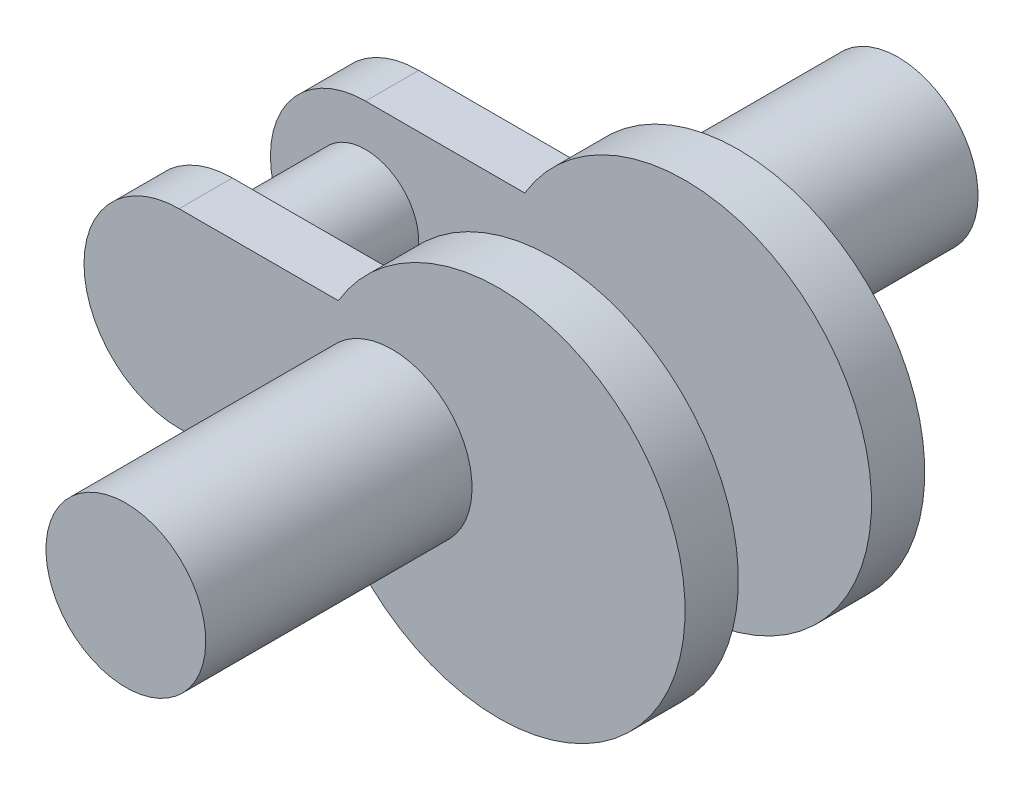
ISO-10303-21;
HEADER;
FILE_DESCRIPTION(('STEP AP214'),'2;1');
FILE_NAME('part.step','',(''),(''),'','','');
FILE_SCHEMA(('AUTOMOTIVE_DESIGN { 1 0 10303 214 1 1 1 1 }'));
ENDSEC;
DATA;
#1=APPLICATION_CONTEXT('core data for automotive mechanical design processes');
#2=APPLICATION_PROTOCOL_DEFINITION('international standard','automotive_design',2000,#1);
#3=PRODUCT_CONTEXT('',#1,'mechanical');
#4=PRODUCT('Part','Part','',(#3));
#5=PRODUCT_RELATED_PRODUCT_CATEGORY('part','',(#4));
#6=PRODUCT_DEFINITION_FORMATION('','',#4);
#7=PRODUCT_DEFINITION_CONTEXT('part definition',#1,'design');
#8=PRODUCT_DEFINITION('design','',#6,#7);
#9=PRODUCT_DEFINITION_SHAPE('','',#8);
#10=(LENGTH_UNIT() NAMED_UNIT(*) SI_UNIT(.MILLI.,.METRE.));
#11=(NAMED_UNIT(*) PLANE_ANGLE_UNIT() SI_UNIT($,.RADIAN.));
#12=(NAMED_UNIT(*) SI_UNIT($,.STERADIAN.) SOLID_ANGLE_UNIT());
#13=UNCERTAINTY_MEASURE_WITH_UNIT(LENGTH_MEASURE(1.E-05),#10,'distance_accuracy_value','');
#14=(GEOMETRIC_REPRESENTATION_CONTEXT(3) GLOBAL_UNCERTAINTY_ASSIGNED_CONTEXT((#13)) GLOBAL_UNIT_ASSIGNED_CONTEXT((#10,
#11,#12)) REPRESENTATION_CONTEXT('',''));
#15=CARTESIAN_POINT('',(0.,0.,0.));
#16=DIRECTION('',(0.,0.,1.));
#17=DIRECTION('',(1.,0.,0.));
#18=AXIS2_PLACEMENT_3D('',#15,#16,#17);
#19=CARTESIAN_POINT('',(-396.363758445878,-302.221968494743,358.902522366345));
#20=DIRECTION('',(0.,0.,-1.));
#21=DIRECTION('',(0.,-1.,0.));
#22=AXIS2_PLACEMENT_3D('',#19,#20,#21);
#23=PLANE('',#22);
#24=CARTESIAN_POINT('',(-396.363758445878,-302.221968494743,358.902522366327));
#25=DIRECTION('',(0.,0.,1.));
#26=DIRECTION('',(0.,1.,0.));
#27=AXIS2_PLACEMENT_3D('',#24,#25,#26);
#28=CIRCLE('',#27,30.);
#29=CARTESIAN_POINT('',(-396.363758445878,-272.221968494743,358.902522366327));
#30=VERTEX_POINT('',#29);
#31=EDGE_CURVE('E10',#30,#30,#28,.T.);
#32=ORIENTED_EDGE('',*,*,#31,.F.);
#33=EDGE_LOOP('',(#32));
#34=FACE_BOUND('',#33,.T.);
#35=DIRECTION('',(-1.,0.,0.));
#36=VECTOR('',#35,1.);
#37=CARTESIAN_POINT('',(-396.363758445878,-337.936254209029,358.902522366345));
#38=LINE('',#37,#36);
#39=CARTESIAN_POINT('',(-416.567494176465,-337.936254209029,358.902522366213));
#40=VERTEX_POINT('',#39);
#41=CARTESIAN_POINT('',(-476.363758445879,-337.936254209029,358.902522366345));
#42=VERTEX_POINT('',#41);
#43=EDGE_CURVE('E129',#40,#42,#38,.T.);
#44=ORIENTED_EDGE('',*,*,#43,.F.);
#45=CARTESIAN_POINT('',(-356.363758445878,-302.221968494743,358.902522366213));
#46=DIRECTION('',(0.,0.,1.));
#47=DIRECTION('',(0.,1.,0.));
#48=AXIS2_PLACEMENT_3D('',#45,#46,#47);
#49=CIRCLE('',#48,70.);
#50=CARTESIAN_POINT('',(-416.567494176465,-266.507682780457,358.902522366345));
#51=VERTEX_POINT('',#50);
#52=EDGE_CURVE('E108',#40,#51,#49,.T.);
#53=ORIENTED_EDGE('',*,*,#52,.T.);
#54=DIRECTION('',(-1.,0.,0.));
#55=VECTOR('',#54,1.);
#56=CARTESIAN_POINT('',(-396.363758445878,-266.507682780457,358.902522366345));
#57=LINE('',#56,#55);
#58=CARTESIAN_POINT('',(-476.363758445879,-266.507682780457,358.902522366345));
#59=VERTEX_POINT('',#58);
#60=EDGE_CURVE('E134',#51,#59,#57,.T.);
#61=ORIENTED_EDGE('',*,*,#60,.T.);
#62=CARTESIAN_POINT('',(-476.363758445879,-302.221968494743,358.902522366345));
#63=DIRECTION('',(0.,0.,-1.));
#64=DIRECTION('',(0.,-1.,0.));
#65=AXIS2_PLACEMENT_3D('',#62,#63,#64);
#66=CIRCLE('',#65,35.7142857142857);
#67=EDGE_CURVE('E131',#42,#59,#66,.T.);
#68=ORIENTED_EDGE('',*,*,#67,.F.);
#69=EDGE_LOOP('',(#44,#53,#61,#68));
#70=FACE_BOUND('',#69,.T.);
#71=ADVANCED_FACE('F16',(#34,#70),#23,.F.);
#72=CARTESIAN_POINT('',(-396.363758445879,-302.221968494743,288.902522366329));
#73=DIRECTION('',(0.,0.,-1.));
#74=DIRECTION('',(0.,-1.,0.));
#75=AXIS2_PLACEMENT_3D('',#72,#73,#74);
#76=PLANE('',#75);
#77=DIRECTION('',(-1.,0.,0.));
#78=VECTOR('',#77,1.);
#79=CARTESIAN_POINT('',(-396.363758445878,-337.936254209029,288.902522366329));
#80=LINE('',#79,#78);
#81=CARTESIAN_POINT('',(-416.567494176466,-337.936254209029,288.902522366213));
#82=VERTEX_POINT('',#81);
#83=CARTESIAN_POINT('',(-476.363758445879,-337.936254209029,288.902522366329));
#84=VERTEX_POINT('',#83);
#85=EDGE_CURVE('E81',#82,#84,#80,.T.);
#86=ORIENTED_EDGE('',*,*,#85,.F.);
#87=CARTESIAN_POINT('',(-356.363758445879,-302.221968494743,288.902522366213));
#88=DIRECTION('',(0.,0.,1.));
#89=DIRECTION('',(0.,1.,0.));
#90=AXIS2_PLACEMENT_3D('',#87,#88,#89);
#91=CIRCLE('',#90,70.);
#92=CARTESIAN_POINT('',(-416.567494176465,-266.507682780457,288.902522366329));
#93=VERTEX_POINT('',#92);
#94=EDGE_CURVE('E86',#82,#93,#91,.T.);
#95=ORIENTED_EDGE('',*,*,#94,.T.);
#96=DIRECTION('',(-1.,0.,0.));
#97=VECTOR('',#96,1.);
#98=CARTESIAN_POINT('',(-396.363758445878,-266.507682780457,288.902522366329));
#99=LINE('',#98,#97);
#100=CARTESIAN_POINT('',(-476.363758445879,-266.507682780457,288.902522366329));
#101=VERTEX_POINT('',#100);
#102=EDGE_CURVE('E33',#93,#101,#99,.T.);
#103=ORIENTED_EDGE('',*,*,#102,.T.);
#104=CARTESIAN_POINT('',(-476.363758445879,-302.221968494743,288.902522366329));
#105=DIRECTION('',(0.,0.,-1.));
#106=DIRECTION('',(0.,-1.,0.));
#107=AXIS2_PLACEMENT_3D('',#104,#105,#106);
#108=CIRCLE('',#107,35.7142857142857);
#109=EDGE_CURVE('E88',#84,#101,#108,.T.);
#110=ORIENTED_EDGE('',*,*,#109,.F.);
#111=EDGE_LOOP('',(#86,#95,#103,#110));
#112=FACE_BOUND('',#111,.T.);
#113=CARTESIAN_POINT('',(-476.363758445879,-302.221968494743,288.902522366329));
#114=DIRECTION('',(0.,0.,1.));
#115=DIRECTION('',(0.,1.,0.));
#116=AXIS2_PLACEMENT_3D('',#113,#114,#115);
#117=CIRCLE('',#116,20.);
#118=CARTESIAN_POINT('',(-476.363758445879,-282.221968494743,288.902522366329));
#119=VERTEX_POINT('',#118);
#120=EDGE_CURVE('E25',#119,#119,#117,.T.);
#121=ORIENTED_EDGE('',*,*,#120,.F.);
#122=EDGE_LOOP('',(#121));
#123=FACE_BOUND('',#122,.T.);
#124=ADVANCED_FACE('F83',(#112,#123),#76,.F.);
#125=CARTESIAN_POINT('',(-396.363758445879,-302.221968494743,268.902522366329));
#126=DIRECTION('',(0.,0.,-1.));
#127=DIRECTION('',(0.,-1.,0.));
#128=AXIS2_PLACEMENT_3D('',#125,#126,#127);
#129=CYLINDRICAL_SURFACE('',#128,30.);
#130=CARTESIAN_POINT('',(-396.363758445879,-302.221968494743,268.902522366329));
#131=DIRECTION('',(0.,0.,1.));
#132=DIRECTION('',(0.,1.,0.));
#133=AXIS2_PLACEMENT_3D('',#130,#131,#132);
#134=CIRCLE('',#133,30.);
#135=CARTESIAN_POINT('',(-396.363758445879,-272.221968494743,268.902522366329));
#136=VERTEX_POINT('',#135);
#137=EDGE_CURVE('E20',#136,#136,#134,.T.);
#138=ORIENTED_EDGE('',*,*,#137,.F.);
#139=EDGE_LOOP('',(#138));
#140=FACE_BOUND('',#139,.T.);
#141=CARTESIAN_POINT('',(-396.363758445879,-302.221968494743,168.902522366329));
#142=DIRECTION('',(0.,0.,1.));
#143=DIRECTION('',(0.,1.,0.));
#144=AXIS2_PLACEMENT_3D('',#141,#142,#143);
#145=CIRCLE('',#144,30.);
#146=CARTESIAN_POINT('',(-396.363758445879,-272.221968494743,168.902522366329));
#147=VERTEX_POINT('',#146);
#148=EDGE_CURVE('E158',#147,#147,#145,.T.);
#149=ORIENTED_EDGE('',*,*,#148,.T.);
#150=EDGE_LOOP('',(#149));
#151=FACE_BOUND('',#150,.T.);
#152=ADVANCED_FACE('F18',(#140,#151),#129,.T.);
#153=CARTESIAN_POINT('',(-396.363758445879,-302.221968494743,168.902522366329));
#154=DIRECTION('',(0.,0.,1.));
#155=DIRECTION('',(0.,1.,0.));
#156=AXIS2_PLACEMENT_3D('',#153,#154,#155);
#157=PLANE('',#156);
#158=ORIENTED_EDGE('',*,*,#148,.F.);
#159=EDGE_LOOP('',(#158));
#160=FACE_BOUND('',#159,.T.);
#161=ADVANCED_FACE('F168',(#160),#157,.F.);
#162=CARTESIAN_POINT('',(-396.363758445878,-266.507682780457,288.902522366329));
#163=DIRECTION('',(0.,-1.,0.));
#164=DIRECTION('',(1.,0.,0.));
#165=AXIS2_PLACEMENT_3D('',#162,#163,#164);
#166=PLANE('',#165);
#167=ORIENTED_EDGE('',*,*,#102,.F.);
#168=DIRECTION('',(0.,0.,1.));
#169=VECTOR('',#168,1.);
#170=CARTESIAN_POINT('',(-416.567494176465,-266.507682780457,268.902522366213));
#171=LINE('',#170,#169);
#172=CARTESIAN_POINT('',(-416.567494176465,-266.507682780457,268.902522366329));
#173=VERTEX_POINT('',#172);
#174=EDGE_CURVE('E37',#93,#173,#171,.F.);
#175=ORIENTED_EDGE('',*,*,#174,.T.);
#176=DIRECTION('',(-1.,0.,0.));
#177=VECTOR('',#176,1.);
#178=CARTESIAN_POINT('',(-396.363758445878,-266.507682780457,268.902522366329));
#179=LINE('',#178,#177);
#180=CARTESIAN_POINT('',(-476.363758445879,-266.507682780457,268.902522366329));
#181=VERTEX_POINT('',#180);
#182=EDGE_CURVE('E92',#173,#181,#179,.T.);
#183=ORIENTED_EDGE('',*,*,#182,.T.);
#184=DIRECTION('',(0.,0.,-1.));
#185=VECTOR('',#184,1.);
#186=CARTESIAN_POINT('',(-476.363758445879,-266.507682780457,288.902522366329));
#187=LINE('',#186,#185);
#188=EDGE_CURVE('E155',#101,#181,#187,.T.);
#189=ORIENTED_EDGE('',*,*,#188,.F.);
#190=EDGE_LOOP('',(#167,#175,#183,#189));
#191=FACE_BOUND('',#190,.T.);
#192=ADVANCED_FACE('F174',(#191),#166,.F.);
#193=CARTESIAN_POINT('',(-476.363758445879,-302.221968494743,288.902522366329));
#194=DIRECTION('',(0.,0.,-1.));
#195=DIRECTION('',(0.,-1.,0.));
#196=AXIS2_PLACEMENT_3D('',#193,#194,#195);
#197=CYLINDRICAL_SURFACE('',#196,35.7142857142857);
#198=CARTESIAN_POINT('',(-476.363758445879,-302.221968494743,268.902522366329));
#199=DIRECTION('',(0.,0.,-1.));
#200=DIRECTION('',(0.,-1.,0.));
#201=AXIS2_PLACEMENT_3D('',#198,#199,#200);
#202=CIRCLE('',#201,35.7142857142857);
#203=CARTESIAN_POINT('',(-476.363758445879,-337.936254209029,268.902522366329));
#204=VERTEX_POINT('',#203);
#205=EDGE_CURVE('E148',#204,#181,#202,.T.);
#206=ORIENTED_EDGE('',*,*,#205,.F.);
#207=DIRECTION('',(0.,0.,-1.));
#208=VECTOR('',#207,1.);
#209=CARTESIAN_POINT('',(-476.363758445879,-337.936254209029,288.902522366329));
#210=LINE('',#209,#208);
#211=EDGE_CURVE('E154',#84,#204,#210,.T.);
#212=ORIENTED_EDGE('',*,*,#211,.F.);
#213=ORIENTED_EDGE('',*,*,#109,.T.);
#214=ORIENTED_EDGE('',*,*,#188,.T.);
#215=EDGE_LOOP('',(#206,#212,#213,#214));
#216=FACE_BOUND('',#215,.T.);
#217=ADVANCED_FACE('F209',(#216),#197,.T.);
#218=CARTESIAN_POINT('',(-396.363758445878,-337.936254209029,288.902522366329));
#219=DIRECTION('',(0.,-1.,0.));
#220=DIRECTION('',(1.,0.,0.));
#221=AXIS2_PLACEMENT_3D('',#218,#219,#220);
#222=PLANE('',#221);
#223=DIRECTION('',(0.,0.,1.));
#224=VECTOR('',#223,1.);
#225=CARTESIAN_POINT('',(-416.567494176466,-337.936254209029,268.902522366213));
#226=LINE('',#225,#224);
#227=CARTESIAN_POINT('',(-416.567494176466,-337.936254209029,268.902522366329));
#228=VERTEX_POINT('',#227);
#229=EDGE_CURVE('E95',#82,#228,#226,.F.);
#230=ORIENTED_EDGE('',*,*,#229,.F.);
#231=ORIENTED_EDGE('',*,*,#85,.T.);
#232=ORIENTED_EDGE('',*,*,#211,.T.);
#233=DIRECTION('',(-1.,0.,0.));
#234=VECTOR('',#233,1.);
#235=CARTESIAN_POINT('',(-396.363758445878,-337.936254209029,268.902522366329));
#236=LINE('',#235,#234);
#237=EDGE_CURVE('E97',#228,#204,#236,.T.);
#238=ORIENTED_EDGE('',*,*,#237,.F.);
#239=EDGE_LOOP('',(#230,#231,#232,#238));
#240=FACE_BOUND('',#239,.T.);
#241=ADVANCED_FACE('F96',(#240),#222,.T.);
#242=CARTESIAN_POINT('',(-396.363758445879,-302.221968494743,268.902522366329));
#243=DIRECTION('',(0.,0.,-1.));
#244=DIRECTION('',(0.,-1.,0.));
#245=AXIS2_PLACEMENT_3D('',#242,#243,#244);
#246=PLANE('',#245);
#247=ORIENTED_EDGE('',*,*,#182,.F.);
#248=CARTESIAN_POINT('',(-356.363758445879,-302.221968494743,268.902522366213));
#249=DIRECTION('',(0.,0.,1.));
#250=DIRECTION('',(0.,1.,0.));
#251=AXIS2_PLACEMENT_3D('',#248,#249,#250);
#252=CIRCLE('',#251,70.);
#253=EDGE_CURVE('E101',#228,#173,#252,.T.);
#254=ORIENTED_EDGE('',*,*,#253,.F.);
#255=ORIENTED_EDGE('',*,*,#237,.T.);
#256=ORIENTED_EDGE('',*,*,#205,.T.);
#257=EDGE_LOOP('',(#247,#254,#255,#256));
#258=FACE_BOUND('',#257,.T.);
#259=ORIENTED_EDGE('',*,*,#137,.T.);
#260=EDGE_LOOP('',(#259));
#261=FACE_BOUND('',#260,.T.);
#262=ADVANCED_FACE('F165',(#258,#261),#246,.T.);
#263=CARTESIAN_POINT('',(-476.363758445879,-302.221968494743,338.902522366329));
#264=DIRECTION('',(0.,0.,-1.));
#265=DIRECTION('',(0.,-1.,0.));
#266=AXIS2_PLACEMENT_3D('',#263,#264,#265);
#267=CYLINDRICAL_SURFACE('',#266,20.);
#268=CARTESIAN_POINT('',(-476.363758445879,-302.221968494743,338.902522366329));
#269=DIRECTION('',(0.,0.,1.));
#270=DIRECTION('',(0.,1.,0.));
#271=AXIS2_PLACEMENT_3D('',#268,#269,#270);
#272=CIRCLE('',#271,20.);
#273=CARTESIAN_POINT('',(-476.363758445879,-282.221968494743,338.902522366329));
#274=VERTEX_POINT('',#273);
#275=EDGE_CURVE('E140',#274,#274,#272,.T.);
#276=ORIENTED_EDGE('',*,*,#275,.F.);
#277=EDGE_LOOP('',(#276));
#278=FACE_BOUND('',#277,.T.);
#279=ORIENTED_EDGE('',*,*,#120,.T.);
#280=EDGE_LOOP('',(#279));
#281=FACE_BOUND('',#280,.T.);
#282=ADVANCED_FACE('F192',(#278,#281),#267,.T.);
#283=CARTESIAN_POINT('',(-396.363758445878,-266.507682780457,358.902522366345));
#284=DIRECTION('',(0.,-1.,0.));
#285=DIRECTION('',(0.,0.,1.));
#286=AXIS2_PLACEMENT_3D('',#283,#284,#285);
#287=PLANE('',#286);
#288=ORIENTED_EDGE('',*,*,#60,.F.);
#289=DIRECTION('',(0.,0.,1.));
#290=VECTOR('',#289,1.);
#291=CARTESIAN_POINT('',(-416.567494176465,-266.507682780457,338.902522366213));
#292=LINE('',#291,#290);
#293=CARTESIAN_POINT('',(-416.567494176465,-266.507682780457,338.902522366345));
#294=VERTEX_POINT('',#293);
#295=EDGE_CURVE('E117',#51,#294,#292,.F.);
#296=ORIENTED_EDGE('',*,*,#295,.T.);
#297=DIRECTION('',(-1.,0.,0.));
#298=VECTOR('',#297,1.);
#299=CARTESIAN_POINT('',(-396.363758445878,-266.507682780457,338.902522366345));
#300=LINE('',#299,#298);
#301=CARTESIAN_POINT('',(-476.363758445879,-266.507682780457,338.902522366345));
#302=VERTEX_POINT('',#301);
#303=EDGE_CURVE('E127',#294,#302,#300,.T.);
#304=ORIENTED_EDGE('',*,*,#303,.T.);
#305=DIRECTION('',(0.,0.,-1.));
#306=VECTOR('',#305,1.);
#307=CARTESIAN_POINT('',(-476.363758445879,-266.507682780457,358.902522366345));
#308=LINE('',#307,#306);
#309=EDGE_CURVE('E137',#59,#302,#308,.T.);
#310=ORIENTED_EDGE('',*,*,#309,.F.);
#311=EDGE_LOOP('',(#288,#296,#304,#310));
#312=FACE_BOUND('',#311,.T.);
#313=ADVANCED_FACE('F188',(#312),#287,.F.);
#314=CARTESIAN_POINT('',(-476.363758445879,-302.221968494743,358.902522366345));
#315=DIRECTION('',(0.,0.,-1.));
#316=DIRECTION('',(0.,-1.,0.));
#317=AXIS2_PLACEMENT_3D('',#314,#315,#316);
#318=CYLINDRICAL_SURFACE('',#317,35.7142857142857);
#319=CARTESIAN_POINT('',(-476.363758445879,-302.221968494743,338.902522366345));
#320=DIRECTION('',(0.,0.,-1.));
#321=DIRECTION('',(0.,-1.,0.));
#322=AXIS2_PLACEMENT_3D('',#319,#320,#321);
#323=CIRCLE('',#322,35.7142857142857);
#324=CARTESIAN_POINT('',(-476.363758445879,-337.936254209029,338.902522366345));
#325=VERTEX_POINT('',#324);
#326=EDGE_CURVE('E124',#325,#302,#323,.T.);
#327=ORIENTED_EDGE('',*,*,#326,.F.);
#328=DIRECTION('',(0.,0.,-1.));
#329=VECTOR('',#328,1.);
#330=CARTESIAN_POINT('',(-476.363758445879,-337.936254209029,358.902522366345));
#331=LINE('',#330,#329);
#332=EDGE_CURVE('E136',#42,#325,#331,.T.);
#333=ORIENTED_EDGE('',*,*,#332,.F.);
#334=ORIENTED_EDGE('',*,*,#67,.T.);
#335=ORIENTED_EDGE('',*,*,#309,.T.);
#336=EDGE_LOOP('',(#327,#333,#334,#335));
#337=FACE_BOUND('',#336,.T.);
#338=ADVANCED_FACE('F191',(#337),#318,.T.);
#339=CARTESIAN_POINT('',(-396.363758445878,-337.936254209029,358.902522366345));
#340=DIRECTION('',(0.,-1.,0.));
#341=DIRECTION('',(1.,0.,0.));
#342=AXIS2_PLACEMENT_3D('',#339,#340,#341);
#343=PLANE('',#342);
#344=DIRECTION('',(0.,0.,1.));
#345=VECTOR('',#344,1.);
#346=CARTESIAN_POINT('',(-416.567494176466,-337.936254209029,338.902522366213));
#347=LINE('',#346,#345);
#348=CARTESIAN_POINT('',(-416.567494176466,-337.936254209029,338.902522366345));
#349=VERTEX_POINT('',#348);
#350=EDGE_CURVE('E114',#40,#349,#347,.F.);
#351=ORIENTED_EDGE('',*,*,#350,.F.);
#352=ORIENTED_EDGE('',*,*,#43,.T.);
#353=ORIENTED_EDGE('',*,*,#332,.T.);
#354=DIRECTION('',(-1.,0.,0.));
#355=VECTOR('',#354,1.);
#356=CARTESIAN_POINT('',(-396.363758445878,-337.936254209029,338.902522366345));
#357=LINE('',#356,#355);
#358=EDGE_CURVE('E122',#349,#325,#357,.T.);
#359=ORIENTED_EDGE('',*,*,#358,.F.);
#360=EDGE_LOOP('',(#351,#352,#353,#359));
#361=FACE_BOUND('',#360,.T.);
#362=ADVANCED_FACE('F196',(#361),#343,.T.);
#363=CARTESIAN_POINT('',(-396.363758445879,-302.221968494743,338.902522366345));
#364=DIRECTION('',(0.,0.,-1.));
#365=DIRECTION('',(0.,-1.,0.));
#366=AXIS2_PLACEMENT_3D('',#363,#364,#365);
#367=PLANE('',#366);
#368=ORIENTED_EDGE('',*,*,#303,.F.);
#369=CARTESIAN_POINT('',(-356.363758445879,-302.221968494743,338.902522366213));
#370=DIRECTION('',(0.,0.,1.));
#371=DIRECTION('',(0.,1.,0.));
#372=AXIS2_PLACEMENT_3D('',#369,#370,#371);
#373=CIRCLE('',#372,70.);
#374=EDGE_CURVE('E111',#349,#294,#373,.T.);
#375=ORIENTED_EDGE('',*,*,#374,.F.);
#376=ORIENTED_EDGE('',*,*,#358,.T.);
#377=ORIENTED_EDGE('',*,*,#326,.T.);
#378=EDGE_LOOP('',(#368,#375,#376,#377));
#379=FACE_BOUND('',#378,.T.);
#380=ORIENTED_EDGE('',*,*,#275,.T.);
#381=EDGE_LOOP('',(#380));
#382=FACE_BOUND('',#381,.T.);
#383=ADVANCED_FACE('F186',(#379,#382),#367,.T.);
#384=CARTESIAN_POINT('',(-396.363758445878,-302.221968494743,458.902522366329));
#385=DIRECTION('',(0.,0.,-1.));
#386=DIRECTION('',(0.,-1.,0.));
#387=AXIS2_PLACEMENT_3D('',#384,#385,#386);
#388=CYLINDRICAL_SURFACE('',#387,30.);
#389=CARTESIAN_POINT('',(-396.363758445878,-302.221968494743,458.902522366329));
#390=DIRECTION('',(0.,0.,1.));
#391=DIRECTION('',(0.,1.,0.));
#392=AXIS2_PLACEMENT_3D('',#389,#390,#391);
#393=CIRCLE('',#392,30.);
#394=CARTESIAN_POINT('',(-396.363758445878,-272.221968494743,458.902522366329));
#395=VERTEX_POINT('',#394);
#396=EDGE_CURVE('E118',#395,#395,#393,.T.);
#397=ORIENTED_EDGE('',*,*,#396,.F.);
#398=EDGE_LOOP('',(#397));
#399=FACE_BOUND('',#398,.T.);
#400=ORIENTED_EDGE('',*,*,#31,.T.);
#401=EDGE_LOOP('',(#400));
#402=FACE_BOUND('',#401,.T.);
#403=ADVANCED_FACE('F246',(#399,#402),#388,.T.);
#404=CARTESIAN_POINT('',(-396.363758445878,-302.221968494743,458.902522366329));
#405=DIRECTION('',(0.,0.,1.));
#406=DIRECTION('',(0.,1.,0.));
#407=AXIS2_PLACEMENT_3D('',#404,#405,#406);
#408=PLANE('',#407);
#409=ORIENTED_EDGE('',*,*,#396,.T.);
#410=EDGE_LOOP('',(#409));
#411=FACE_BOUND('',#410,.T.);
#412=ADVANCED_FACE('F253',(#411),#408,.T.);
#413=CARTESIAN_POINT('',(-356.363758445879,-302.221968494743,338.902522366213));
#414=DIRECTION('',(0.,0.,1.));
#415=DIRECTION('',(0.,1.,0.));
#416=AXIS2_PLACEMENT_3D('',#413,#414,#415);
#417=CYLINDRICAL_SURFACE('',#416,70.);
#418=ORIENTED_EDGE('',*,*,#295,.F.);
#419=ORIENTED_EDGE('',*,*,#52,.F.);
#420=ORIENTED_EDGE('',*,*,#350,.T.);
#421=ORIENTED_EDGE('',*,*,#374,.T.);
#422=EDGE_LOOP('',(#418,#419,#420,#421));
#423=FACE_BOUND('',#422,.T.);
#424=ADVANCED_FACE('F260',(#423),#417,.T.);
#425=CARTESIAN_POINT('',(-356.363758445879,-302.221968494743,268.902522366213));
#426=DIRECTION('',(0.,0.,1.));
#427=DIRECTION('',(0.,1.,0.));
#428=AXIS2_PLACEMENT_3D('',#425,#426,#427);
#429=CYLINDRICAL_SURFACE('',#428,70.);
#430=ORIENTED_EDGE('',*,*,#174,.F.);
#431=ORIENTED_EDGE('',*,*,#94,.F.);
#432=ORIENTED_EDGE('',*,*,#229,.T.);
#433=ORIENTED_EDGE('',*,*,#253,.T.);
#434=EDGE_LOOP('',(#430,#431,#432,#433));
#435=FACE_BOUND('',#434,.T.);
#436=ADVANCED_FACE('F103',(#435),#429,.T.);
#437=CLOSED_SHELL('',(#71,#124,#152,#161,#192,#217,#241,#262,#282,#313,#338,#362,#383,#403,#412,
#424,#436));
#438=MANIFOLD_SOLID_BREP('B1',#437);
#439=ADVANCED_BREP_SHAPE_REPRESENTATION('',(#18,#438),#14);
#440=SHAPE_DEFINITION_REPRESENTATION(#9,#439);
ENDSEC;
END-ISO-10303-21;
